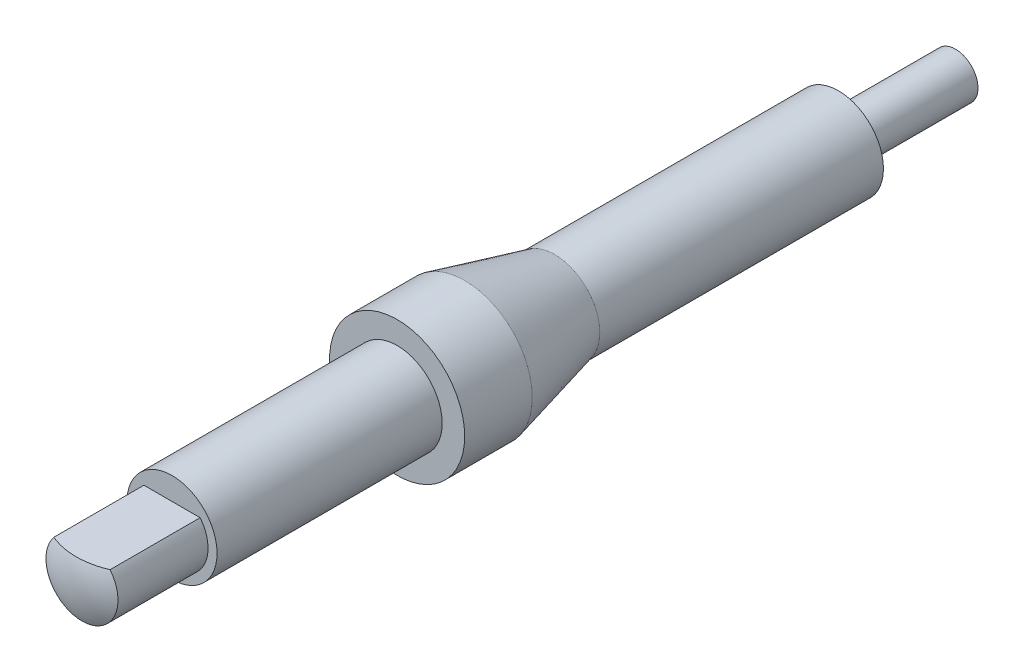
from build123d import *

# Parameters (mm, degrees)
SKETCH3_W          = 20
SKETCH3_H          = 3.770906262
CUT_EXTRUDE2_DEPTH = 22


with BuildPart() as part:
    # Sketch1 → Revolve2 (revolve)
    with BuildSketch(Plane(origin=(0, 0, 0), x_dir=(0, 0, -1), z_dir=(1, 0, 0)), mode=Mode.PRIVATE) as revolve2_sk:
        with BuildLine():
            Line((-2.057842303, 0), (195.254878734, 0))
            ThreePointArc((195.254878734, 0), (194.936368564, 2.577533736), (194, 5))
            Line((194, 5), (168, 5))
            Line((168, 5), (168, 10))
            Line((168, 10), (105, 10))
            Line((105, 10), (85, 15))
            Line((85, 15), (70, 15))
            Line((70, 15), (70, 10))
            Line((70, 10), (20, 10))
            Line((20, 10), (20, 8))
            Line((20, 8), (0, 8))
            ThreePointArc((0, 8), (-1.535142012, 4.130215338), (-2.057842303, 0))
        make_face()
    revolve(revolve2_sk.sketch.rotate(Axis((0, 0, 2.057842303), (0, 0, -1)), 90), axis=Axis((0, 0, 2.057842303), (0, 0, -1)))

    # Sketch3 → Cut-Extrude2 (cut)
    with BuildSketch(Plane.XY.offset(-20)):
        with Locations((0, 6.885453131)):
            Rectangle(SKETCH3_W, SKETCH3_H)
    extrude(amount=CUT_EXTRUDE2_DEPTH, mode=Mode.SUBTRACT)


solid = part.part
